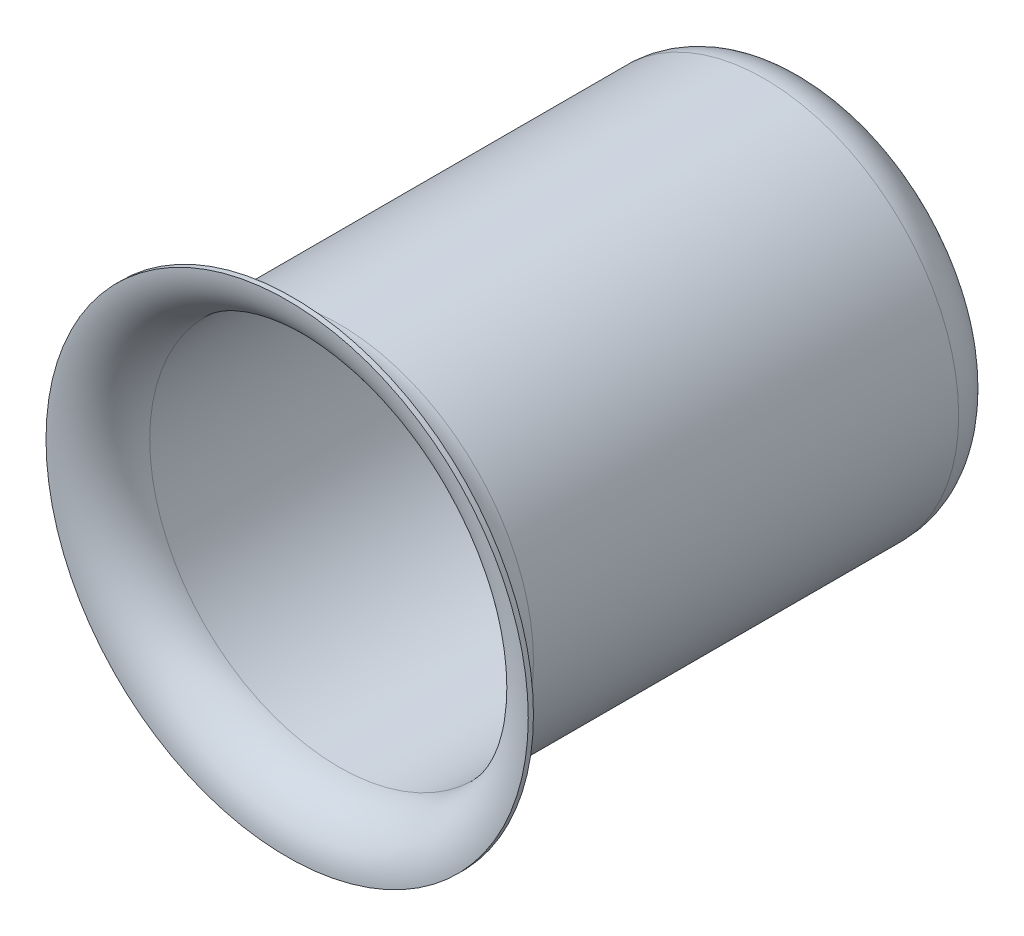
ISO-10303-21;
HEADER;
FILE_DESCRIPTION(('STEP AP214'),'2;1');
FILE_NAME('part.step','',(''),(''),'','','');
FILE_SCHEMA(('AUTOMOTIVE_DESIGN { 1 0 10303 214 1 1 1 1 }'));
ENDSEC;
DATA;
#1=APPLICATION_CONTEXT('core data for automotive mechanical design processes');
#2=APPLICATION_PROTOCOL_DEFINITION('international standard','automotive_design',2000,#1);
#3=PRODUCT_CONTEXT('',#1,'mechanical');
#4=PRODUCT('Part','Part','',(#3));
#5=PRODUCT_RELATED_PRODUCT_CATEGORY('part','',(#4));
#6=PRODUCT_DEFINITION_FORMATION('','',#4);
#7=PRODUCT_DEFINITION_CONTEXT('part definition',#1,'design');
#8=PRODUCT_DEFINITION('design','',#6,#7);
#9=PRODUCT_DEFINITION_SHAPE('','',#8);
#10=(LENGTH_UNIT() NAMED_UNIT(*) SI_UNIT(.MILLI.,.METRE.));
#11=(NAMED_UNIT(*) PLANE_ANGLE_UNIT() SI_UNIT($,.RADIAN.));
#12=(NAMED_UNIT(*) SI_UNIT($,.STERADIAN.) SOLID_ANGLE_UNIT());
#13=UNCERTAINTY_MEASURE_WITH_UNIT(LENGTH_MEASURE(1.E-05),#10,'distance_accuracy_value','');
#14=(GEOMETRIC_REPRESENTATION_CONTEXT(3) GLOBAL_UNCERTAINTY_ASSIGNED_CONTEXT((#13)) GLOBAL_UNIT_ASSIGNED_CONTEXT((#10,
#11,#12)) REPRESENTATION_CONTEXT('',''));
#15=CARTESIAN_POINT('',(0.,0.,0.));
#16=DIRECTION('',(0.,0.,1.));
#17=DIRECTION('',(1.,0.,0.));
#18=AXIS2_PLACEMENT_3D('',#15,#16,#17);
#19=CARTESIAN_POINT('',(-4.34999999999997,48.31,8.36));
#20=DIRECTION('',(0.,0.,1.));
#21=DIRECTION('',(1.,0.,0.));
#22=AXIS2_PLACEMENT_3D('',#19,#20,#21);
#23=PLANE('',#22);
#24=CARTESIAN_POINT('',(-4.34999999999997,48.31,8.36));
#25=DIRECTION('',(0.,0.,-1.));
#26=DIRECTION('',(-1.,0.,0.));
#27=AXIS2_PLACEMENT_3D('',#24,#25,#26);
#28=CIRCLE('',#27,0.285);
#29=CARTESIAN_POINT('',(-4.63499999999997,48.31,8.36));
#30=VERTEX_POINT('',#29);
#31=EDGE_CURVE('E88',#30,#30,#28,.F.);
#32=ORIENTED_EDGE('',*,*,#31,.T.);
#33=EDGE_LOOP('',(#32));
#34=FACE_BOUND('',#33,.T.);
#35=ADVANCED_FACE('F15',(#34),#23,.T.);
#36=CARTESIAN_POINT('',(-4.34999999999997,48.31,8.44));
#37=DIRECTION('',(0.,0.,1.));
#38=DIRECTION('',(1.,0.,0.));
#39=AXIS2_PLACEMENT_3D('',#36,#37,#38);
#40=TOROIDAL_SURFACE('',#39,0.285,0.08);
#41=CARTESIAN_POINT('',(-4.34999999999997,48.31,8.44));
#42=DIRECTION('',(0.,0.,1.));
#43=DIRECTION('',(1.,0.,0.));
#44=AXIS2_PLACEMENT_3D('',#41,#42,#43);
#45=CIRCLE('',#44,0.365);
#46=CARTESIAN_POINT('',(-3.98499999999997,48.31,8.44));
#47=VERTEX_POINT('',#46);
#48=EDGE_CURVE('E83',#47,#47,#45,.T.);
#49=ORIENTED_EDGE('',*,*,#48,.T.);
#50=EDGE_LOOP('',(#49));
#51=FACE_BOUND('',#50,.T.);
#52=ORIENTED_EDGE('',*,*,#31,.F.);
#53=EDGE_LOOP('',(#52));
#54=FACE_BOUND('',#53,.T.);
#55=ADVANCED_FACE('F75',(#51,#54),#40,.F.);
#56=CARTESIAN_POINT('',(-4.34999999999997,48.31,8.35));
#57=DIRECTION('',(0.,0.,1.));
#58=DIRECTION('',(1.,0.,0.));
#59=AXIS2_PLACEMENT_3D('',#56,#57,#58);
#60=CYLINDRICAL_SURFACE('',#59,0.365);
#61=CARTESIAN_POINT('',(-4.34999999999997,48.31,9.26));
#62=DIRECTION('',(0.,0.,-1.));
#63=DIRECTION('',(-1.,0.,0.));
#64=AXIS2_PLACEMENT_3D('',#61,#62,#63);
#65=CIRCLE('',#64,0.365);
#66=CARTESIAN_POINT('',(-4.71499999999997,48.31,9.26));
#67=VERTEX_POINT('',#66);
#68=EDGE_CURVE('E62',#67,#67,#65,.T.);
#69=ORIENTED_EDGE('',*,*,#68,.F.);
#70=EDGE_LOOP('',(#69));
#71=FACE_BOUND('',#70,.T.);
#72=ORIENTED_EDGE('',*,*,#48,.F.);
#73=EDGE_LOOP('',(#72));
#74=FACE_BOUND('',#73,.T.);
#75=ADVANCED_FACE('F72',(#71,#74),#60,.F.);
#76=CARTESIAN_POINT('',(-4.34999999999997,48.31,9.26));
#77=DIRECTION('',(0.,0.,-1.));
#78=DIRECTION('',(-1.,0.,0.));
#79=AXIS2_PLACEMENT_3D('',#76,#77,#78);
#80=TOROIDAL_SURFACE('',#79,0.465,0.1);
#81=ORIENTED_EDGE('',*,*,#68,.T.);
#82=EDGE_LOOP('',(#81));
#83=FACE_BOUND('',#82,.T.);
#84=CARTESIAN_POINT('',(-4.34999999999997,48.31,9.36));
#85=DIRECTION('',(0.,0.,-1.));
#86=DIRECTION('',(-1.,0.,0.));
#87=AXIS2_PLACEMENT_3D('',#84,#85,#86);
#88=CIRCLE('',#87,0.465);
#89=CARTESIAN_POINT('',(-4.81499999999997,48.31,9.36));
#90=VERTEX_POINT('',#89);
#91=EDGE_CURVE('E53',#90,#90,#88,.T.);
#92=ORIENTED_EDGE('',*,*,#91,.F.);
#93=EDGE_LOOP('',(#92));
#94=FACE_BOUND('',#93,.T.);
#95=ADVANCED_FACE('F67',(#83,#94),#80,.T.);
#96=CARTESIAN_POINT('',(-4.34999999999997,48.31,9.26));
#97=DIRECTION('',(0.,0.,-1.));
#98=DIRECTION('',(-1.,0.,0.));
#99=AXIS2_PLACEMENT_3D('',#96,#97,#98);
#100=CYLINDRICAL_SURFACE('',#99,0.465);
#101=ORIENTED_EDGE('',*,*,#91,.T.);
#102=EDGE_LOOP('',(#101));
#103=FACE_BOUND('',#102,.T.);
#104=CARTESIAN_POINT('',(-4.34999999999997,48.31,9.35));
#105=DIRECTION('',(0.,0.,-1.));
#106=DIRECTION('',(-1.,0.,0.));
#107=AXIS2_PLACEMENT_3D('',#104,#105,#106);
#108=CIRCLE('',#107,0.465);
#109=CARTESIAN_POINT('',(-4.81499999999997,48.31,9.35));
#110=VERTEX_POINT('',#109);
#111=EDGE_CURVE('E61',#110,#110,#108,.F.);
#112=ORIENTED_EDGE('',*,*,#111,.T.);
#113=EDGE_LOOP('',(#112));
#114=FACE_BOUND('',#113,.T.);
#115=ADVANCED_FACE('F71',(#103,#114),#100,.T.);
#116=CARTESIAN_POINT('',(-4.34999999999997,48.31,8.35));
#117=DIRECTION('',(0.,0.,1.));
#118=DIRECTION('',(1.,0.,0.));
#119=AXIS2_PLACEMENT_3D('',#116,#117,#118);
#120=PLANE('',#119);
#121=CARTESIAN_POINT('',(-4.34999999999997,48.31,8.35));
#122=DIRECTION('',(0.,0.,1.));
#123=DIRECTION('',(-1.,0.,0.));
#124=AXIS2_PLACEMENT_3D('',#121,#122,#123);
#125=CIRCLE('',#124,0.285);
#126=CARTESIAN_POINT('',(-4.63499999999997,48.31,8.35));
#127=VERTEX_POINT('',#126);
#128=EDGE_CURVE('E29',#127,#127,#125,.T.);
#129=ORIENTED_EDGE('',*,*,#128,.F.);
#130=EDGE_LOOP('',(#129));
#131=FACE_BOUND('',#130,.T.);
#132=ADVANCED_FACE('F107',(#131),#120,.F.);
#133=CARTESIAN_POINT('',(-4.34999999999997,48.31,9.26));
#134=DIRECTION('',(0.,0.,-1.));
#135=DIRECTION('',(-1.,0.,0.));
#136=AXIS2_PLACEMENT_3D('',#133,#134,#135);
#137=TOROIDAL_SURFACE('',#136,0.465,0.09);
#138=ORIENTED_EDGE('',*,*,#111,.F.);
#139=EDGE_LOOP('',(#138));
#140=FACE_BOUND('',#139,.T.);
#141=CARTESIAN_POINT('',(-4.34999999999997,48.31,9.26));
#142=DIRECTION('',(0.,0.,1.));
#143=DIRECTION('',(1.,0.,0.));
#144=AXIS2_PLACEMENT_3D('',#141,#142,#143);
#145=CIRCLE('',#144,0.375);
#146=CARTESIAN_POINT('',(-3.97499999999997,48.31,9.26));
#147=VERTEX_POINT('',#146);
#148=EDGE_CURVE('E24',#147,#147,#145,.F.);
#149=ORIENTED_EDGE('',*,*,#148,.F.);
#150=EDGE_LOOP('',(#149));
#151=FACE_BOUND('',#150,.T.);
#152=ADVANCED_FACE('F43',(#140,#151),#137,.F.);
#153=CARTESIAN_POINT('',(-4.34999999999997,48.31,8.44));
#154=DIRECTION('',(0.,0.,1.));
#155=DIRECTION('',(1.,0.,0.));
#156=AXIS2_PLACEMENT_3D('',#153,#154,#155);
#157=TOROIDAL_SURFACE('',#156,0.285,0.09);
#158=ORIENTED_EDGE('',*,*,#128,.T.);
#159=EDGE_LOOP('',(#158));
#160=FACE_BOUND('',#159,.T.);
#161=CARTESIAN_POINT('',(-4.34999999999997,48.31,8.44));
#162=DIRECTION('',(0.,0.,1.));
#163=DIRECTION('',(1.,0.,0.));
#164=AXIS2_PLACEMENT_3D('',#161,#162,#163);
#165=CIRCLE('',#164,0.375);
#166=CARTESIAN_POINT('',(-3.97499999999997,48.31,8.44));
#167=VERTEX_POINT('',#166);
#168=EDGE_CURVE('E10',#167,#167,#165,.T.);
#169=ORIENTED_EDGE('',*,*,#168,.F.);
#170=EDGE_LOOP('',(#169));
#171=FACE_BOUND('',#170,.T.);
#172=ADVANCED_FACE('F37',(#160,#171),#157,.T.);
#173=CARTESIAN_POINT('',(-4.34999999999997,48.31,8.35));
#174=DIRECTION('',(0.,0.,1.));
#175=DIRECTION('',(1.,0.,0.));
#176=AXIS2_PLACEMENT_3D('',#173,#174,#175);
#177=CYLINDRICAL_SURFACE('',#176,0.375);
#178=ORIENTED_EDGE('',*,*,#168,.T.);
#179=EDGE_LOOP('',(#178));
#180=FACE_BOUND('',#179,.T.);
#181=ORIENTED_EDGE('',*,*,#148,.T.);
#182=EDGE_LOOP('',(#181));
#183=FACE_BOUND('',#182,.T.);
#184=ADVANCED_FACE('F42',(#180,#183),#177,.T.);
#185=CLOSED_SHELL('',(#35,#55,#75,#95,#115,#132,#152,#172,#184));
#186=MANIFOLD_SOLID_BREP('B1',#185);
#187=ADVANCED_BREP_SHAPE_REPRESENTATION('',(#18,#186),#14);
#188=SHAPE_DEFINITION_REPRESENTATION(#9,#187);
ENDSEC;
END-ISO-10303-21;
